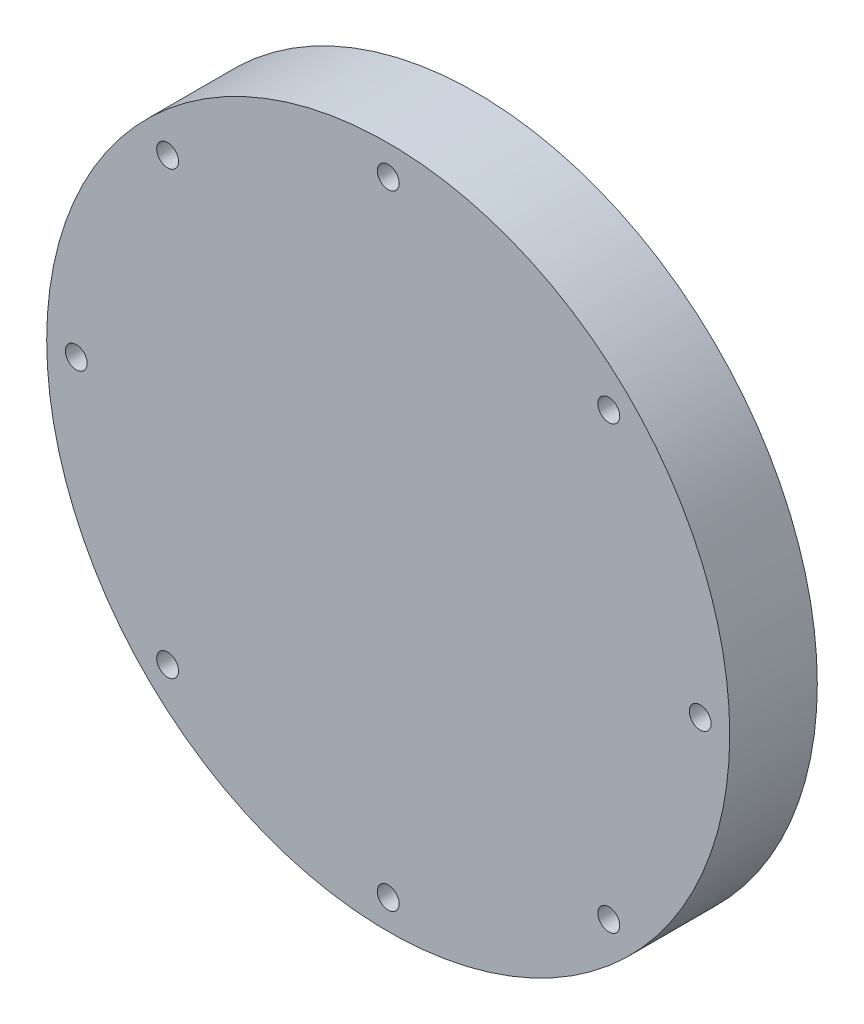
ISO-10303-21;
HEADER;
FILE_DESCRIPTION(('STEP AP214'),'2;1');
FILE_NAME('part.step','',(''),(''),'','','');
FILE_SCHEMA(('AUTOMOTIVE_DESIGN { 1 0 10303 214 1 1 1 1 }'));
ENDSEC;
DATA;
#1=APPLICATION_CONTEXT('core data for automotive mechanical design processes');
#2=APPLICATION_PROTOCOL_DEFINITION('international standard','automotive_design',2000,#1);
#3=PRODUCT_CONTEXT('',#1,'mechanical');
#4=PRODUCT('Part','Part','',(#3));
#5=PRODUCT_RELATED_PRODUCT_CATEGORY('part','',(#4));
#6=PRODUCT_DEFINITION_FORMATION('','',#4);
#7=PRODUCT_DEFINITION_CONTEXT('part definition',#1,'design');
#8=PRODUCT_DEFINITION('design','',#6,#7);
#9=PRODUCT_DEFINITION_SHAPE('','',#8);
#10=(LENGTH_UNIT() NAMED_UNIT(*) SI_UNIT(.MILLI.,.METRE.));
#11=(NAMED_UNIT(*) PLANE_ANGLE_UNIT() SI_UNIT($,.RADIAN.));
#12=(NAMED_UNIT(*) SI_UNIT($,.STERADIAN.) SOLID_ANGLE_UNIT());
#13=UNCERTAINTY_MEASURE_WITH_UNIT(LENGTH_MEASURE(1.E-05),#10,'distance_accuracy_value','');
#14=(GEOMETRIC_REPRESENTATION_CONTEXT(3) GLOBAL_UNCERTAINTY_ASSIGNED_CONTEXT((#13)) GLOBAL_UNIT_ASSIGNED_CONTEXT((#10,
#11,#12)) REPRESENTATION_CONTEXT('',''));
#15=CARTESIAN_POINT('',(0.,0.,0.));
#16=DIRECTION('',(0.,0.,1.));
#17=DIRECTION('',(1.,0.,0.));
#18=AXIS2_PLACEMENT_3D('',#15,#16,#17);
#19=CARTESIAN_POINT('',(0.,0.,25.4));
#20=DIRECTION('',(0.,0.,1.));
#21=DIRECTION('',(1.,0.,0.));
#22=AXIS2_PLACEMENT_3D('',#19,#20,#21);
#23=PLANE('',#22);
#24=CARTESIAN_POINT('',(90.4875,-3.15935600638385E-13,25.4));
#25=DIRECTION('',(0.,0.,1.));
#26=DIRECTION('',(1.,0.,0.));
#27=AXIS2_PLACEMENT_3D('',#24,#25,#26);
#28=CIRCLE('',#27,3.175);
#29=CARTESIAN_POINT('',(93.6625,-3.15935600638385E-13,25.4));
#30=VERTEX_POINT('',#29);
#31=EDGE_CURVE('E74',#30,#30,#28,.T.);
#32=ORIENTED_EDGE('',*,*,#31,.F.);
#33=EDGE_LOOP('',(#32));
#34=FACE_BOUND('',#33,.T.);
#35=CARTESIAN_POINT('',(0.,90.4875,25.4));
#36=DIRECTION('',(0.,0.,1.));
#37=DIRECTION('',(1.,0.,0.));
#38=AXIS2_PLACEMENT_3D('',#35,#36,#37);
#39=CIRCLE('',#38,3.175);
#40=CARTESIAN_POINT('',(3.175,90.4875,25.4));
#41=VERTEX_POINT('',#40);
#42=EDGE_CURVE('E62',#41,#41,#39,.T.);
#43=ORIENTED_EDGE('',*,*,#42,.F.);
#44=EDGE_LOOP('',(#43));
#45=FACE_BOUND('',#44,.T.);
#46=CARTESIAN_POINT('',(-90.4875,9.47806801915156E-13,25.4));
#47=DIRECTION('',(0.,0.,1.));
#48=DIRECTION('',(1.,0.,0.));
#49=AXIS2_PLACEMENT_3D('',#46,#47,#48);
#50=CIRCLE('',#49,3.175);
#51=CARTESIAN_POINT('',(-87.3125,9.47806801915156E-13,25.4));
#52=VERTEX_POINT('',#51);
#53=EDGE_CURVE('E50',#52,#52,#50,.T.);
#54=ORIENTED_EDGE('',*,*,#53,.F.);
#55=EDGE_LOOP('',(#54));
#56=FACE_BOUND('',#55,.T.);
#57=CARTESIAN_POINT('',(-6.3187120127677E-13,-90.4875,25.4));
#58=DIRECTION('',(0.,0.,1.));
#59=DIRECTION('',(1.,0.,0.));
#60=AXIS2_PLACEMENT_3D('',#57,#58,#59);
#61=CIRCLE('',#60,3.175);
#62=CARTESIAN_POINT('',(3.17499999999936,-90.4875,25.4));
#63=VERTEX_POINT('',#62);
#64=EDGE_CURVE('E39',#63,#63,#61,.T.);
#65=ORIENTED_EDGE('',*,*,#64,.F.);
#66=EDGE_LOOP('',(#65));
#67=FACE_BOUND('',#66,.T.);
#68=CARTESIAN_POINT('',(0.,0.,25.4));
#69=DIRECTION('',(0.,0.,1.));
#70=DIRECTION('',(1.,0.,0.));
#71=AXIS2_PLACEMENT_3D('',#68,#69,#70);
#72=CIRCLE('',#71,99.06);
#73=CARTESIAN_POINT('',(99.06,0.,25.4));
#74=VERTEX_POINT('',#73);
#75=EDGE_CURVE('E10',#74,#74,#72,.T.);
#76=ORIENTED_EDGE('',*,*,#75,.T.);
#77=EDGE_LOOP('',(#76));
#78=FACE_BOUND('',#77,.T.);
#79=CARTESIAN_POINT('',(-63.9843248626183,-63.9843248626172,25.4));
#80=DIRECTION('',(0.,0.,1.));
#81=DIRECTION('',(1.,0.,0.));
#82=AXIS2_PLACEMENT_3D('',#79,#80,#81);
#83=CIRCLE('',#82,3.175);
#84=CARTESIAN_POINT('',(-60.8093248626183,-63.9843248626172,25.4));
#85=VERTEX_POINT('',#84);
#86=EDGE_CURVE('E44',#85,#85,#83,.T.);
#87=ORIENTED_EDGE('',*,*,#86,.F.);
#88=EDGE_LOOP('',(#87));
#89=FACE_BOUND('',#88,.T.);
#90=CARTESIAN_POINT('',(-63.9843248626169,63.9843248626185,25.4));
#91=DIRECTION('',(0.,0.,1.));
#92=DIRECTION('',(1.,0.,0.));
#93=AXIS2_PLACEMENT_3D('',#90,#91,#92);
#94=CIRCLE('',#93,3.175);
#95=CARTESIAN_POINT('',(-60.8093248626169,63.9843248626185,25.4));
#96=VERTEX_POINT('',#95);
#97=EDGE_CURVE('E56',#96,#96,#94,.T.);
#98=ORIENTED_EDGE('',*,*,#97,.F.);
#99=EDGE_LOOP('',(#98));
#100=FACE_BOUND('',#99,.T.);
#101=CARTESIAN_POINT('',(63.9843248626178,63.9843248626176,25.4));
#102=DIRECTION('',(0.,0.,1.));
#103=DIRECTION('',(1.,0.,0.));
#104=AXIS2_PLACEMENT_3D('',#101,#102,#103);
#105=CIRCLE('',#104,3.175);
#106=CARTESIAN_POINT('',(67.1593248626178,63.9843248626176,25.4));
#107=VERTEX_POINT('',#106);
#108=EDGE_CURVE('E68',#107,#107,#105,.T.);
#109=ORIENTED_EDGE('',*,*,#108,.F.);
#110=EDGE_LOOP('',(#109));
#111=FACE_BOUND('',#110,.T.);
#112=CARTESIAN_POINT('',(63.9843248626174,-63.9843248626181,25.4));
#113=DIRECTION('',(0.,0.,1.));
#114=DIRECTION('',(1.,0.,0.));
#115=AXIS2_PLACEMENT_3D('',#112,#113,#114);
#116=CIRCLE('',#115,3.175);
#117=CARTESIAN_POINT('',(67.1593248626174,-63.9843248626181,25.4));
#118=VERTEX_POINT('',#117);
#119=EDGE_CURVE('E80',#118,#118,#116,.T.);
#120=ORIENTED_EDGE('',*,*,#119,.F.);
#121=EDGE_LOOP('',(#120));
#122=FACE_BOUND('',#121,.T.);
#123=ADVANCED_FACE('F28',(#34,#45,#56,#67,#78,#89,#100,#111,#122),#23,.T.);
#124=CARTESIAN_POINT('',(0.,0.,0.));
#125=DIRECTION('',(0.,0.,1.));
#126=DIRECTION('',(1.,0.,0.));
#127=AXIS2_PLACEMENT_3D('',#124,#125,#126);
#128=PLANE('',#127);
#129=CARTESIAN_POINT('',(90.4875,-3.15935600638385E-13,0.));
#130=DIRECTION('',(0.,0.,1.));
#131=DIRECTION('',(1.,0.,0.));
#132=AXIS2_PLACEMENT_3D('',#129,#130,#131);
#133=CIRCLE('',#132,3.175);
#134=CARTESIAN_POINT('',(93.6625,-3.15935600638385E-13,0.));
#135=VERTEX_POINT('',#134);
#136=EDGE_CURVE('E77',#135,#135,#133,.T.);
#137=ORIENTED_EDGE('',*,*,#136,.T.);
#138=EDGE_LOOP('',(#137));
#139=FACE_BOUND('',#138,.T.);
#140=CARTESIAN_POINT('',(0.,90.4875,0.));
#141=DIRECTION('',(0.,0.,1.));
#142=DIRECTION('',(1.,0.,0.));
#143=AXIS2_PLACEMENT_3D('',#140,#141,#142);
#144=CIRCLE('',#143,3.175);
#145=CARTESIAN_POINT('',(3.175,90.4875,0.));
#146=VERTEX_POINT('',#145);
#147=EDGE_CURVE('E65',#146,#146,#144,.T.);
#148=ORIENTED_EDGE('',*,*,#147,.T.);
#149=EDGE_LOOP('',(#148));
#150=FACE_BOUND('',#149,.T.);
#151=CARTESIAN_POINT('',(-90.4875,9.47806801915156E-13,0.));
#152=DIRECTION('',(0.,0.,1.));
#153=DIRECTION('',(1.,0.,0.));
#154=AXIS2_PLACEMENT_3D('',#151,#152,#153);
#155=CIRCLE('',#154,3.175);
#156=CARTESIAN_POINT('',(-87.3125,9.47806801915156E-13,0.));
#157=VERTEX_POINT('',#156);
#158=EDGE_CURVE('E53',#157,#157,#155,.T.);
#159=ORIENTED_EDGE('',*,*,#158,.T.);
#160=EDGE_LOOP('',(#159));
#161=FACE_BOUND('',#160,.T.);
#162=CARTESIAN_POINT('',(-6.3187120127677E-13,-90.4875,0.));
#163=DIRECTION('',(0.,0.,1.));
#164=DIRECTION('',(1.,0.,0.));
#165=AXIS2_PLACEMENT_3D('',#162,#163,#164);
#166=CIRCLE('',#165,3.175);
#167=CARTESIAN_POINT('',(3.17499999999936,-90.4875,0.));
#168=VERTEX_POINT('',#167);
#169=EDGE_CURVE('E41',#168,#168,#166,.T.);
#170=ORIENTED_EDGE('',*,*,#169,.T.);
#171=EDGE_LOOP('',(#170));
#172=FACE_BOUND('',#171,.T.);
#173=CARTESIAN_POINT('',(0.,0.,0.));
#174=DIRECTION('',(0.,0.,1.));
#175=DIRECTION('',(1.,0.,0.));
#176=AXIS2_PLACEMENT_3D('',#173,#174,#175);
#177=CIRCLE('',#176,99.06);
#178=CARTESIAN_POINT('',(99.06,0.,0.));
#179=VERTEX_POINT('',#178);
#180=EDGE_CURVE('E32',#179,#179,#177,.T.);
#181=ORIENTED_EDGE('',*,*,#180,.F.);
#182=EDGE_LOOP('',(#181));
#183=FACE_BOUND('',#182,.T.);
#184=CARTESIAN_POINT('',(-63.9843248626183,-63.9843248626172,0.));
#185=DIRECTION('',(0.,0.,1.));
#186=DIRECTION('',(1.,0.,0.));
#187=AXIS2_PLACEMENT_3D('',#184,#185,#186);
#188=CIRCLE('',#187,3.175);
#189=CARTESIAN_POINT('',(-60.8093248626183,-63.9843248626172,0.));
#190=VERTEX_POINT('',#189);
#191=EDGE_CURVE('E47',#190,#190,#188,.T.);
#192=ORIENTED_EDGE('',*,*,#191,.T.);
#193=EDGE_LOOP('',(#192));
#194=FACE_BOUND('',#193,.T.);
#195=CARTESIAN_POINT('',(-63.9843248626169,63.9843248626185,0.));
#196=DIRECTION('',(0.,0.,1.));
#197=DIRECTION('',(1.,0.,0.));
#198=AXIS2_PLACEMENT_3D('',#195,#196,#197);
#199=CIRCLE('',#198,3.175);
#200=CARTESIAN_POINT('',(-60.8093248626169,63.9843248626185,0.));
#201=VERTEX_POINT('',#200);
#202=EDGE_CURVE('E59',#201,#201,#199,.T.);
#203=ORIENTED_EDGE('',*,*,#202,.T.);
#204=EDGE_LOOP('',(#203));
#205=FACE_BOUND('',#204,.T.);
#206=CARTESIAN_POINT('',(63.9843248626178,63.9843248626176,0.));
#207=DIRECTION('',(0.,0.,1.));
#208=DIRECTION('',(1.,0.,0.));
#209=AXIS2_PLACEMENT_3D('',#206,#207,#208);
#210=CIRCLE('',#209,3.175);
#211=CARTESIAN_POINT('',(67.1593248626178,63.9843248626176,0.));
#212=VERTEX_POINT('',#211);
#213=EDGE_CURVE('E71',#212,#212,#210,.T.);
#214=ORIENTED_EDGE('',*,*,#213,.T.);
#215=EDGE_LOOP('',(#214));
#216=FACE_BOUND('',#215,.T.);
#217=CARTESIAN_POINT('',(63.9843248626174,-63.9843248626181,0.));
#218=DIRECTION('',(0.,0.,1.));
#219=DIRECTION('',(1.,0.,0.));
#220=AXIS2_PLACEMENT_3D('',#217,#218,#219);
#221=CIRCLE('',#220,3.175);
#222=CARTESIAN_POINT('',(67.1593248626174,-63.9843248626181,0.));
#223=VERTEX_POINT('',#222);
#224=EDGE_CURVE('E83',#223,#223,#221,.T.);
#225=ORIENTED_EDGE('',*,*,#224,.T.);
#226=EDGE_LOOP('',(#225));
#227=FACE_BOUND('',#226,.T.);
#228=ADVANCED_FACE('F93',(#139,#150,#161,#172,#183,#194,#205,#216,#227),#128,.F.);
#229=CARTESIAN_POINT('',(0.,0.,25.4));
#230=DIRECTION('',(0.,0.,-1.));
#231=DIRECTION('',(-1.,0.,0.));
#232=AXIS2_PLACEMENT_3D('',#229,#230,#231);
#233=CYLINDRICAL_SURFACE('',#232,99.06);
#234=ORIENTED_EDGE('',*,*,#75,.F.);
#235=EDGE_LOOP('',(#234));
#236=FACE_BOUND('',#235,.T.);
#237=ORIENTED_EDGE('',*,*,#180,.T.);
#238=EDGE_LOOP('',(#237));
#239=FACE_BOUND('',#238,.T.);
#240=ADVANCED_FACE('F30',(#236,#239),#233,.T.);
#241=CARTESIAN_POINT('',(-6.3187120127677E-13,-90.4875,25.4));
#242=DIRECTION('',(0.,0.,-1.));
#243=DIRECTION('',(-1.,0.,0.));
#244=AXIS2_PLACEMENT_3D('',#241,#242,#243);
#245=CYLINDRICAL_SURFACE('',#244,3.175);
#246=ORIENTED_EDGE('',*,*,#64,.T.);
#247=EDGE_LOOP('',(#246));
#248=FACE_BOUND('',#247,.T.);
#249=ORIENTED_EDGE('',*,*,#169,.F.);
#250=EDGE_LOOP('',(#249));
#251=FACE_BOUND('',#250,.T.);
#252=ADVANCED_FACE('F103',(#248,#251),#245,.F.);
#253=CARTESIAN_POINT('',(-63.9843248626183,-63.9843248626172,25.4));
#254=DIRECTION('',(0.,0.,-1.));
#255=DIRECTION('',(-1.,0.,0.));
#256=AXIS2_PLACEMENT_3D('',#253,#254,#255);
#257=CYLINDRICAL_SURFACE('',#256,3.175);
#258=ORIENTED_EDGE('',*,*,#86,.T.);
#259=EDGE_LOOP('',(#258));
#260=FACE_BOUND('',#259,.T.);
#261=ORIENTED_EDGE('',*,*,#191,.F.);
#262=EDGE_LOOP('',(#261));
#263=FACE_BOUND('',#262,.T.);
#264=ADVANCED_FACE('F106',(#260,#263),#257,.F.);
#265=CARTESIAN_POINT('',(-90.4875,9.47806801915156E-13,25.4));
#266=DIRECTION('',(0.,0.,-1.));
#267=DIRECTION('',(-1.,0.,0.));
#268=AXIS2_PLACEMENT_3D('',#265,#266,#267);
#269=CYLINDRICAL_SURFACE('',#268,3.175);
#270=ORIENTED_EDGE('',*,*,#53,.T.);
#271=EDGE_LOOP('',(#270));
#272=FACE_BOUND('',#271,.T.);
#273=ORIENTED_EDGE('',*,*,#158,.F.);
#274=EDGE_LOOP('',(#273));
#275=FACE_BOUND('',#274,.T.);
#276=ADVANCED_FACE('F110',(#272,#275),#269,.F.);
#277=CARTESIAN_POINT('',(-63.9843248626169,63.9843248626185,25.4));
#278=DIRECTION('',(0.,0.,-1.));
#279=DIRECTION('',(-1.,0.,0.));
#280=AXIS2_PLACEMENT_3D('',#277,#278,#279);
#281=CYLINDRICAL_SURFACE('',#280,3.175);
#282=ORIENTED_EDGE('',*,*,#97,.T.);
#283=EDGE_LOOP('',(#282));
#284=FACE_BOUND('',#283,.T.);
#285=ORIENTED_EDGE('',*,*,#202,.F.);
#286=EDGE_LOOP('',(#285));
#287=FACE_BOUND('',#286,.T.);
#288=ADVANCED_FACE('F114',(#284,#287),#281,.F.);
#289=CARTESIAN_POINT('',(0.,90.4875,25.4));
#290=DIRECTION('',(0.,0.,-1.));
#291=DIRECTION('',(-1.,0.,0.));
#292=AXIS2_PLACEMENT_3D('',#289,#290,#291);
#293=CYLINDRICAL_SURFACE('',#292,3.175);
#294=ORIENTED_EDGE('',*,*,#42,.T.);
#295=EDGE_LOOP('',(#294));
#296=FACE_BOUND('',#295,.T.);
#297=ORIENTED_EDGE('',*,*,#147,.F.);
#298=EDGE_LOOP('',(#297));
#299=FACE_BOUND('',#298,.T.);
#300=ADVANCED_FACE('F118',(#296,#299),#293,.F.);
#301=CARTESIAN_POINT('',(63.9843248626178,63.9843248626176,25.4));
#302=DIRECTION('',(0.,0.,-1.));
#303=DIRECTION('',(-1.,0.,0.));
#304=AXIS2_PLACEMENT_3D('',#301,#302,#303);
#305=CYLINDRICAL_SURFACE('',#304,3.175);
#306=ORIENTED_EDGE('',*,*,#108,.T.);
#307=EDGE_LOOP('',(#306));
#308=FACE_BOUND('',#307,.T.);
#309=ORIENTED_EDGE('',*,*,#213,.F.);
#310=EDGE_LOOP('',(#309));
#311=FACE_BOUND('',#310,.T.);
#312=ADVANCED_FACE('F122',(#308,#311),#305,.F.);
#313=CARTESIAN_POINT('',(90.4875,-3.15935600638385E-13,25.4));
#314=DIRECTION('',(0.,0.,-1.));
#315=DIRECTION('',(-1.,0.,0.));
#316=AXIS2_PLACEMENT_3D('',#313,#314,#315);
#317=CYLINDRICAL_SURFACE('',#316,3.175);
#318=ORIENTED_EDGE('',*,*,#31,.T.);
#319=EDGE_LOOP('',(#318));
#320=FACE_BOUND('',#319,.T.);
#321=ORIENTED_EDGE('',*,*,#136,.F.);
#322=EDGE_LOOP('',(#321));
#323=FACE_BOUND('',#322,.T.);
#324=ADVANCED_FACE('F126',(#320,#323),#317,.F.);
#325=CARTESIAN_POINT('',(63.9843248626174,-63.9843248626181,25.4));
#326=DIRECTION('',(0.,0.,-1.));
#327=DIRECTION('',(-1.,0.,0.));
#328=AXIS2_PLACEMENT_3D('',#325,#326,#327);
#329=CYLINDRICAL_SURFACE('',#328,3.175);
#330=ORIENTED_EDGE('',*,*,#119,.T.);
#331=EDGE_LOOP('',(#330));
#332=FACE_BOUND('',#331,.T.);
#333=ORIENTED_EDGE('',*,*,#224,.F.);
#334=EDGE_LOOP('',(#333));
#335=FACE_BOUND('',#334,.T.);
#336=ADVANCED_FACE('F89',(#332,#335),#329,.F.);
#337=CLOSED_SHELL('',(#123,#228,#240,#252,#264,#276,#288,#300,#312,#324,#336));
#338=MANIFOLD_SOLID_BREP('B2',#337);
#339=ADVANCED_BREP_SHAPE_REPRESENTATION('',(#18,#338),#14);
#340=SHAPE_DEFINITION_REPRESENTATION(#9,#339);
ENDSEC;
END-ISO-10303-21;
